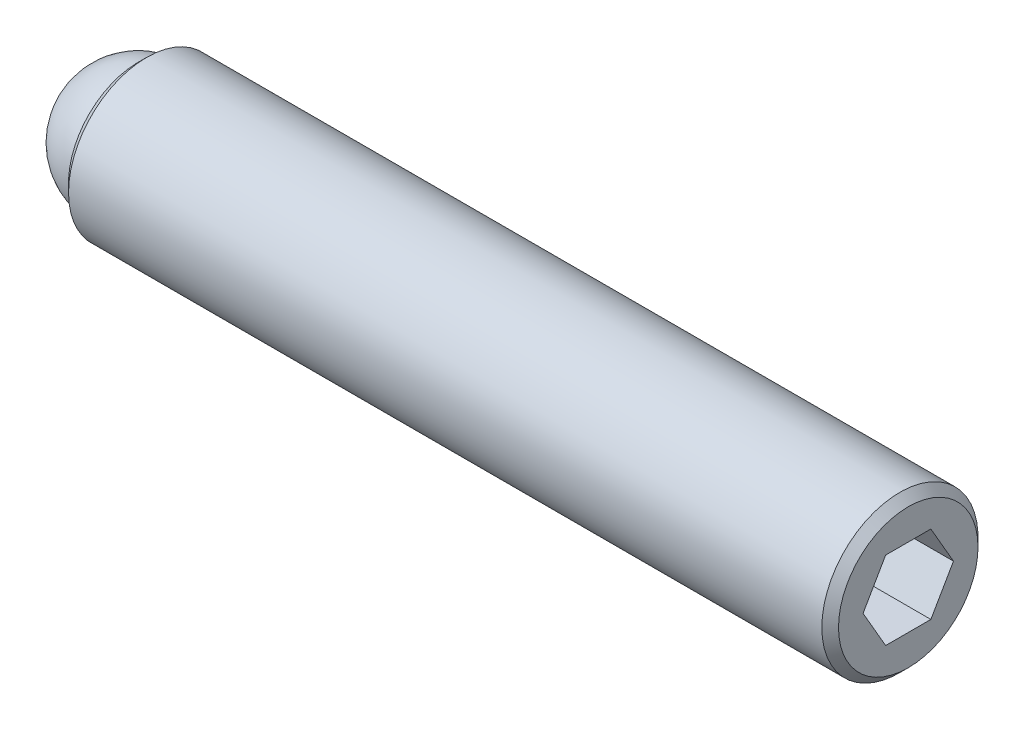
ISO-10303-21;
HEADER;
FILE_DESCRIPTION(('STEP AP214'),'2;1');
FILE_NAME('part.step','',(''),(''),'','','');
FILE_SCHEMA(('AUTOMOTIVE_DESIGN { 1 0 10303 214 1 1 1 1 }'));
ENDSEC;
DATA;
#1=APPLICATION_CONTEXT('core data for automotive mechanical design processes');
#2=APPLICATION_PROTOCOL_DEFINITION('international standard','automotive_design',2000,#1);
#3=PRODUCT_CONTEXT('',#1,'mechanical');
#4=PRODUCT('Part','Part','',(#3));
#5=PRODUCT_RELATED_PRODUCT_CATEGORY('part','',(#4));
#6=PRODUCT_DEFINITION_FORMATION('','',#4);
#7=PRODUCT_DEFINITION_CONTEXT('part definition',#1,'design');
#8=PRODUCT_DEFINITION('design','',#6,#7);
#9=PRODUCT_DEFINITION_SHAPE('','',#8);
#10=(LENGTH_UNIT() NAMED_UNIT(*) SI_UNIT(.MILLI.,.METRE.));
#11=(NAMED_UNIT(*) PLANE_ANGLE_UNIT() SI_UNIT($,.RADIAN.));
#12=(NAMED_UNIT(*) SI_UNIT($,.STERADIAN.) SOLID_ANGLE_UNIT());
#13=UNCERTAINTY_MEASURE_WITH_UNIT(LENGTH_MEASURE(1.E-05),#10,'distance_accuracy_value','');
#14=(GEOMETRIC_REPRESENTATION_CONTEXT(3) GLOBAL_UNCERTAINTY_ASSIGNED_CONTEXT((#13)) GLOBAL_UNIT_ASSIGNED_CONTEXT((#10,
#11,#12)) REPRESENTATION_CONTEXT('',''));
#15=CARTESIAN_POINT('',(0.,0.,0.));
#16=DIRECTION('',(0.,0.,1.));
#17=DIRECTION('',(1.,0.,0.));
#18=AXIS2_PLACEMENT_3D('',#15,#16,#17);
#19=CARTESIAN_POINT('',(0.,0.,0.));
#20=DIRECTION('',(0.,-1.,0.));
#21=DIRECTION('',(0.,0.,1.));
#22=AXIS2_PLACEMENT_3D('',#19,#20,#21);
#23=SPHERICAL_SURFACE('',#22,1.984375);
#24=CARTESIAN_POINT('',(0.,-1.984375,0.));
#25=VERTEX_POINT('',#24);
#26=VERTEX_LOOP('',#25);
#27=FACE_BOUND('',#26,.T.);
#28=ADVANCED_FACE('F41',(#27),#23,.T.);
#29=CLOSED_SHELL('',(#28));
#30=MANIFOLD_SOLID_BREP('B2',#29);
#31=CARTESIAN_POINT('',(23.415625,0.,0.));
#32=DIRECTION('',(-1.,0.,0.));
#33=DIRECTION('',(0.,0.,1.));
#34=AXIS2_PLACEMENT_3D('',#31,#32,#33);
#35=CYLINDRICAL_SURFACE('',#34,2.3749);
#36=CARTESIAN_POINT('',(23.161625,0.,0.));
#37=DIRECTION('',(1.,0.,0.));
#38=DIRECTION('',(0.,0.,-1.));
#39=AXIS2_PLACEMENT_3D('',#36,#37,#38);
#40=CIRCLE('',#39,2.3749);
#41=CARTESIAN_POINT('',(23.161625,0.,2.3749));
#42=VERTEX_POINT('',#41);
#43=EDGE_CURVE('E39',#42,#42,#40,.F.);
#44=CARTESIAN_POINT('',(0.254000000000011,0.,0.));
#45=DIRECTION('',(1.,0.,0.));
#46=DIRECTION('',(0.,0.,-1.));
#47=AXIS2_PLACEMENT_3D('',#44,#45,#46);
#48=CIRCLE('',#47,2.3749);
#49=CARTESIAN_POINT('',(0.254000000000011,0.,2.3749));
#50=VERTEX_POINT('',#49);
#51=EDGE_CURVE('E157',#50,#50,#48,.T.);
#52=CARTESIAN_POINT('',(23.161625,0.,2.3749));
#53=CARTESIAN_POINT('',(22.92300390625,0.,2.3749));
#54=CARTESIAN_POINT('',(22.6843828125,0.,2.3749));
#55=CARTESIAN_POINT('',(22.207140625,0.,2.3749));
#56=CARTESIAN_POINT('',(21.96851953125,0.,2.3749));
#57=CARTESIAN_POINT('',(21.49127734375,0.,2.3749));
#58=CARTESIAN_POINT('',(21.25265625,0.,2.3749));
#59=CARTESIAN_POINT('',(20.7754140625,0.,2.3749));
#60=CARTESIAN_POINT('',(20.53679296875,0.,2.3749));
#61=CARTESIAN_POINT('',(20.05955078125,0.,2.3749));
#62=CARTESIAN_POINT('',(19.8209296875,0.,2.3749));
#63=CARTESIAN_POINT('',(19.3436875,0.,2.3749));
#64=CARTESIAN_POINT('',(19.10506640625,0.,2.3749));
#65=CARTESIAN_POINT('',(18.62782421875,0.,2.3749));
#66=CARTESIAN_POINT('',(18.389203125,0.,2.3749));
#67=CARTESIAN_POINT('',(17.9119609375,0.,2.3749));
#68=CARTESIAN_POINT('',(17.67333984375,0.,2.3749));
#69=CARTESIAN_POINT('',(17.19609765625,0.,2.3749));
#70=CARTESIAN_POINT('',(16.9574765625,0.,2.3749));
#71=CARTESIAN_POINT('',(16.480234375,0.,2.3749));
#72=CARTESIAN_POINT('',(16.24161328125,0.,2.3749));
#73=CARTESIAN_POINT('',(15.76437109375,0.,2.3749));
#74=CARTESIAN_POINT('',(15.52575,0.,2.3749));
#75=CARTESIAN_POINT('',(15.0485078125,0.,2.3749));
#76=CARTESIAN_POINT('',(14.80988671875,0.,2.3749));
#77=CARTESIAN_POINT('',(14.33264453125,0.,2.3749));
#78=CARTESIAN_POINT('',(14.0940234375,0.,2.3749));
#79=CARTESIAN_POINT('',(13.61678125,0.,2.3749));
#80=CARTESIAN_POINT('',(13.37816015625,0.,2.3749));
#81=CARTESIAN_POINT('',(12.90091796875,0.,2.3749));
#82=CARTESIAN_POINT('',(12.662296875,0.,2.3749));
#83=CARTESIAN_POINT('',(12.1850546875,0.,2.3749));
#84=CARTESIAN_POINT('',(11.94643359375,0.,2.3749));
#85=CARTESIAN_POINT('',(11.46919140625,0.,2.3749));
#86=CARTESIAN_POINT('',(11.2305703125,0.,2.3749));
#87=CARTESIAN_POINT('',(10.753328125,0.,2.3749));
#88=CARTESIAN_POINT('',(10.51470703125,0.,2.3749));
#89=CARTESIAN_POINT('',(10.03746484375,0.,2.3749));
#90=CARTESIAN_POINT('',(9.79884375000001,0.,2.3749));
#91=CARTESIAN_POINT('',(9.32160156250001,0.,2.3749));
#92=CARTESIAN_POINT('',(9.08298046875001,0.,2.3749));
#93=CARTESIAN_POINT('',(8.60573828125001,0.,2.3749));
#94=CARTESIAN_POINT('',(8.36711718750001,0.,2.3749));
#95=CARTESIAN_POINT('',(7.88987500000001,0.,2.3749));
#96=CARTESIAN_POINT('',(7.65125390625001,0.,2.3749));
#97=CARTESIAN_POINT('',(7.17401171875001,0.,2.3749));
#98=CARTESIAN_POINT('',(6.93539062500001,0.,2.3749));
#99=CARTESIAN_POINT('',(6.45814843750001,0.,2.3749));
#100=CARTESIAN_POINT('',(6.21952734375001,0.,2.3749));
#101=CARTESIAN_POINT('',(5.74228515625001,0.,2.3749));
#102=CARTESIAN_POINT('',(5.50366406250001,0.,2.3749));
#103=CARTESIAN_POINT('',(5.02642187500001,0.,2.3749));
#104=CARTESIAN_POINT('',(4.78780078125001,0.,2.3749));
#105=CARTESIAN_POINT('',(4.31055859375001,0.,2.3749));
#106=CARTESIAN_POINT('',(4.07193750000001,0.,2.3749));
#107=CARTESIAN_POINT('',(3.59469531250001,0.,2.3749));
#108=CARTESIAN_POINT('',(3.35607421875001,0.,2.3749));
#109=CARTESIAN_POINT('',(2.87883203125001,0.,2.3749));
#110=CARTESIAN_POINT('',(2.64021093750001,0.,2.3749));
#111=CARTESIAN_POINT('',(2.16296875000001,0.,2.3749));
#112=CARTESIAN_POINT('',(1.92434765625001,0.,2.3749));
#113=CARTESIAN_POINT('',(1.44710546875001,0.,2.3749));
#114=CARTESIAN_POINT('',(1.20848437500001,0.,2.3749));
#115=CARTESIAN_POINT('',(0.731242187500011,0.,2.3749));
#116=CARTESIAN_POINT('',(0.492621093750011,0.,2.3749));
#117=CARTESIAN_POINT('',(0.254000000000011,0.,2.3749));
#118=B_SPLINE_CURVE_WITH_KNOTS('',3,(#52,#53,#54,#55,#56,#57,#58,#59,#60,#61,#62,#63,#64,#65,
#66,#67,#68,#69,#70,#71,#72,#73,#74,#75,#76,#77,#78,#79,#80,#81,#82,#83,#84,#85,#86,#87,#88,#89,
#90,#91,#92,#93,#94,#95,#96,#97,#98,#99,#100,#101,#102,#103,#104,#105,#106,#107,#108,#109,#110,
#111,#112,#113,#114,#115,#116,#117),.UNSPECIFIED.,.F.,.F.,(4,2,2,2,2,2,2,2,2,2,2,2,2,2,2,2,2,2,
2,2,2,2,2,2,2,2,2,2,2,2,2,2,4),(0.,0.71586328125,1.4317265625,2.14758984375,2.863453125,
3.57931640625,4.2951796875,5.01104296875,5.72690625,6.44276953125,7.1586328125,7.87449609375,
8.590359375,9.30622265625,10.0220859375,10.73794921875,11.4538125,12.16967578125,12.8855390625,
13.60140234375,14.317265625,15.03312890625,15.7489921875,16.46485546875,17.18071875,
17.89658203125,18.6124453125,19.32830859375,20.044171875,20.76003515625,21.4758984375,
22.19176171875,22.907625),.UNSPECIFIED.);
#119=EDGE_CURVE('BSEAM54',#42,#50,#118,.T.);
#120=ORIENTED_EDGE('',*,*,#43,.T.);
#121=ORIENTED_EDGE('',*,*,#51,.T.);
#122=ORIENTED_EDGE('',*,*,#119,.T.);
#123=ORIENTED_EDGE('',*,*,#119,.F.);
#124=EDGE_LOOP('',(#120,#122,#121,#123));
#125=FACE_BOUND('',#124,.T.);
#126=ADVANCED_FACE('F54',(#125),#35,.T.);
#127=CARTESIAN_POINT('',(23.415625,0.,0.));
#128=DIRECTION('',(1.,0.,0.));
#129=DIRECTION('',(0.,0.,-1.));
#130=AXIS2_PLACEMENT_3D('',#127,#128,#129);
#131=PLANE('',#130);
#132=DIRECTION('',(0.,0.866025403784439,-0.5));
#133=VECTOR('',#132,1.);
#134=CARTESIAN_POINT('',(23.415625,-1.190625,-0.687407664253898));
#135=LINE('',#134,#133);
#136=CARTESIAN_POINT('',(23.415625,-1.190625,-0.687407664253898));
#137=VERTEX_POINT('',#136);
#138=CARTESIAN_POINT('',(23.415625,0.,-1.3748153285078));
#139=VERTEX_POINT('',#138);
#140=EDGE_CURVE('E69',#137,#139,#135,.T.);
#141=ORIENTED_EDGE('',*,*,#140,.F.);
#142=DIRECTION('',(0.,0.,-1.));
#143=VECTOR('',#142,1.);
#144=CARTESIAN_POINT('',(23.415625,-1.190625,0.687407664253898));
#145=LINE('',#144,#143);
#146=CARTESIAN_POINT('',(23.415625,-1.190625,0.687407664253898));
#147=VERTEX_POINT('',#146);
#148=EDGE_CURVE('E153',#147,#137,#145,.T.);
#149=ORIENTED_EDGE('',*,*,#148,.F.);
#150=DIRECTION('',(0.,-0.866025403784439,-0.5));
#151=VECTOR('',#150,1.);
#152=CARTESIAN_POINT('',(23.415625,0.,1.3748153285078));
#153=LINE('',#152,#151);
#154=CARTESIAN_POINT('',(23.415625,0.,1.3748153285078));
#155=VERTEX_POINT('',#154);
#156=EDGE_CURVE('E151',#155,#147,#153,.T.);
#157=ORIENTED_EDGE('',*,*,#156,.F.);
#158=DIRECTION('',(0.,-0.866025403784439,0.5));
#159=VECTOR('',#158,1.);
#160=CARTESIAN_POINT('',(23.415625,1.190625,0.687407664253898));
#161=LINE('',#160,#159);
#162=CARTESIAN_POINT('',(23.415625,1.190625,0.687407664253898));
#163=VERTEX_POINT('',#162);
#164=EDGE_CURVE('E117',#163,#155,#161,.T.);
#165=ORIENTED_EDGE('',*,*,#164,.F.);
#166=DIRECTION('',(0.,0.,1.));
#167=VECTOR('',#166,1.);
#168=CARTESIAN_POINT('',(23.415625,1.190625,-0.687407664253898));
#169=LINE('',#168,#167);
#170=CARTESIAN_POINT('',(23.415625,1.190625,-0.687407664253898));
#171=VERTEX_POINT('',#170);
#172=EDGE_CURVE('E147',#171,#163,#169,.T.);
#173=ORIENTED_EDGE('',*,*,#172,.F.);
#174=DIRECTION('',(0.,0.866025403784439,0.5));
#175=VECTOR('',#174,1.);
#176=CARTESIAN_POINT('',(23.415625,0.,-1.3748153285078));
#177=LINE('',#176,#175);
#178=EDGE_CURVE('E143',#139,#171,#177,.T.);
#179=ORIENTED_EDGE('',*,*,#178,.F.);
#180=EDGE_LOOP('',(#141,#149,#157,#165,#173,#179));
#181=FACE_BOUND('',#180,.T.);
#182=CARTESIAN_POINT('',(23.415625,0.,0.));
#183=DIRECTION('',(1.,0.,0.));
#184=DIRECTION('',(0.,0.,-1.));
#185=AXIS2_PLACEMENT_3D('',#182,#183,#184);
#186=CIRCLE('',#185,2.12090000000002);
#187=CARTESIAN_POINT('',(23.415625,0.,-2.12090000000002));
#188=VERTEX_POINT('',#187);
#189=EDGE_CURVE('E62',#188,#188,#186,.T.);
#190=ORIENTED_EDGE('',*,*,#189,.T.);
#191=EDGE_LOOP('',(#190));
#192=FACE_BOUND('',#191,.T.);
#193=ADVANCED_FACE('F170',(#181,#192),#131,.T.);
#194=CARTESIAN_POINT('',(0.,0.,0.));
#195=DIRECTION('',(1.,0.,0.));
#196=DIRECTION('',(0.,0.,-1.));
#197=AXIS2_PLACEMENT_3D('',#194,#195,#196);
#198=PLANE('',#197);
#199=CARTESIAN_POINT('',(0.,0.,0.));
#200=DIRECTION('',(-1.,0.,0.));
#201=DIRECTION('',(0.,0.,1.));
#202=AXIS2_PLACEMENT_3D('',#199,#200,#201);
#203=CIRCLE('',#202,1.9812);
#204=CARTESIAN_POINT('',(0.,0.,1.9812));
#205=VERTEX_POINT('',#204);
#206=EDGE_CURVE('E225',#205,#205,#203,.T.);
#207=ORIENTED_EDGE('',*,*,#206,.F.);
#208=EDGE_LOOP('',(#207));
#209=FACE_BOUND('',#208,.T.);
#210=CARTESIAN_POINT('',(0.,0.,0.));
#211=DIRECTION('',(1.,0.,0.));
#212=DIRECTION('',(0.,0.,-1.));
#213=AXIS2_PLACEMENT_3D('',#210,#211,#212);
#214=CIRCLE('',#213,2.12089999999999);
#215=CARTESIAN_POINT('',(0.,0.,-2.12089999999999));
#216=VERTEX_POINT('',#215);
#217=EDGE_CURVE('E165',#216,#216,#214,.F.);
#218=ORIENTED_EDGE('',*,*,#217,.T.);
#219=EDGE_LOOP('',(#218));
#220=FACE_BOUND('',#219,.T.);
#221=ADVANCED_FACE('F182',(#209,#220),#198,.F.);
#222=CARTESIAN_POINT('',(0.254000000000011,0.,0.));
#223=DIRECTION('',(1.,0.,0.));
#224=DIRECTION('',(0.,0.,-1.));
#225=AXIS2_PLACEMENT_3D('',#222,#223,#224);
#226=CONICAL_SURFACE('',#225,2.3749,0.785398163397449);
#227=ORIENTED_EDGE('',*,*,#217,.F.);
#228=EDGE_LOOP('',(#227));
#229=FACE_BOUND('',#228,.T.);
#230=ORIENTED_EDGE('',*,*,#51,.F.);
#231=EDGE_LOOP('',(#230));
#232=FACE_BOUND('',#231,.T.);
#233=ADVANCED_FACE('F174',(#229,#232),#226,.T.);
#234=CARTESIAN_POINT('',(23.415625,0.,0.));
#235=DIRECTION('',(-1.,0.,0.));
#236=DIRECTION('',(0.,0.,1.));
#237=AXIS2_PLACEMENT_3D('',#234,#235,#236);
#238=CONICAL_SURFACE('',#237,2.12090000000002,0.785398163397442);
#239=ORIENTED_EDGE('',*,*,#43,.F.);
#240=EDGE_LOOP('',(#239));
#241=FACE_BOUND('',#240,.T.);
#242=ORIENTED_EDGE('',*,*,#189,.F.);
#243=EDGE_LOOP('',(#242));
#244=FACE_BOUND('',#243,.T.);
#245=ADVANCED_FACE('F56',(#241,#244),#238,.T.);
#246=CARTESIAN_POINT('',(21.129625,-1.190625,-0.687407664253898));
#247=DIRECTION('',(0.,-0.5,-0.866025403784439));
#248=DIRECTION('',(0.,0.866025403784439,-0.5));
#249=AXIS2_PLACEMENT_3D('',#246,#247,#248);
#250=PLANE('',#249);
#251=ORIENTED_EDGE('',*,*,#140,.T.);
#252=DIRECTION('',(1.,0.,0.));
#253=VECTOR('',#252,1.);
#254=CARTESIAN_POINT('',(21.129625,0.,-1.3748153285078));
#255=LINE('',#254,#253);
#256=CARTESIAN_POINT('',(21.129625,0.,-1.3748153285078));
#257=VERTEX_POINT('',#256);
#258=EDGE_CURVE('E99',#257,#139,#255,.T.);
#259=ORIENTED_EDGE('',*,*,#258,.F.);
#260=DIRECTION('',(0.,0.866025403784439,-0.5));
#261=VECTOR('',#260,1.);
#262=CARTESIAN_POINT('',(21.129625,-1.190625,-0.687407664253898));
#263=LINE('',#262,#261);
#264=CARTESIAN_POINT('',(21.129625,-1.190625,-0.687407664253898));
#265=VERTEX_POINT('',#264);
#266=EDGE_CURVE('E155',#265,#257,#263,.T.);
#267=ORIENTED_EDGE('',*,*,#266,.F.);
#268=DIRECTION('',(1.,0.,0.));
#269=VECTOR('',#268,1.);
#270=CARTESIAN_POINT('',(21.129625,-1.190625,-0.687407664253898));
#271=LINE('',#270,#269);
#272=EDGE_CURVE('E77',#265,#137,#271,.T.);
#273=ORIENTED_EDGE('',*,*,#272,.T.);
#274=EDGE_LOOP('',(#251,#259,#267,#273));
#275=FACE_BOUND('',#274,.T.);
#276=ADVANCED_FACE('F173',(#275),#250,.F.);
#277=CARTESIAN_POINT('',(21.129625,-1.190625,0.687407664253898));
#278=DIRECTION('',(0.,-1.,0.));
#279=DIRECTION('',(0.,0.,-1.));
#280=AXIS2_PLACEMENT_3D('',#277,#278,#279);
#281=PLANE('',#280);
#282=ORIENTED_EDGE('',*,*,#148,.T.);
#283=ORIENTED_EDGE('',*,*,#272,.F.);
#284=DIRECTION('',(0.,0.,-1.));
#285=VECTOR('',#284,1.);
#286=CARTESIAN_POINT('',(21.129625,-1.190625,0.687407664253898));
#287=LINE('',#286,#285);
#288=CARTESIAN_POINT('',(21.129625,-1.190625,0.687407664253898));
#289=VERTEX_POINT('',#288);
#290=EDGE_CURVE('E129',#289,#265,#287,.T.);
#291=ORIENTED_EDGE('',*,*,#290,.F.);
#292=DIRECTION('',(1.,0.,0.));
#293=VECTOR('',#292,1.);
#294=CARTESIAN_POINT('',(21.129625,-1.190625,0.687407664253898));
#295=LINE('',#294,#293);
#296=EDGE_CURVE('E121',#289,#147,#295,.T.);
#297=ORIENTED_EDGE('',*,*,#296,.T.);
#298=EDGE_LOOP('',(#282,#283,#291,#297));
#299=FACE_BOUND('',#298,.T.);
#300=ADVANCED_FACE('F180',(#299),#281,.F.);
#301=CARTESIAN_POINT('',(21.129625,0.,1.3748153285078));
#302=DIRECTION('',(0.,-0.5,0.866025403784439));
#303=DIRECTION('',(0.,-0.866025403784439,-0.5));
#304=AXIS2_PLACEMENT_3D('',#301,#302,#303);
#305=PLANE('',#304);
#306=ORIENTED_EDGE('',*,*,#156,.T.);
#307=ORIENTED_EDGE('',*,*,#296,.F.);
#308=DIRECTION('',(0.,-0.866025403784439,-0.5));
#309=VECTOR('',#308,1.);
#310=CARTESIAN_POINT('',(21.129625,0.,1.3748153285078));
#311=LINE('',#310,#309);
#312=CARTESIAN_POINT('',(21.129625,0.,1.3748153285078));
#313=VERTEX_POINT('',#312);
#314=EDGE_CURVE('E125',#313,#289,#311,.T.);
#315=ORIENTED_EDGE('',*,*,#314,.F.);
#316=DIRECTION('',(1.,0.,0.));
#317=VECTOR('',#316,1.);
#318=CARTESIAN_POINT('',(21.129625,0.,1.3748153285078));
#319=LINE('',#318,#317);
#320=EDGE_CURVE('E110',#313,#155,#319,.T.);
#321=ORIENTED_EDGE('',*,*,#320,.T.);
#322=EDGE_LOOP('',(#306,#307,#315,#321));
#323=FACE_BOUND('',#322,.T.);
#324=ADVANCED_FACE('F126',(#323),#305,.F.);
#325=CARTESIAN_POINT('',(21.129625,1.190625,0.687407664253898));
#326=DIRECTION('',(0.,0.5,0.866025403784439));
#327=DIRECTION('',(0.,-0.866025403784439,0.5));
#328=AXIS2_PLACEMENT_3D('',#325,#326,#327);
#329=PLANE('',#328);
#330=ORIENTED_EDGE('',*,*,#164,.T.);
#331=ORIENTED_EDGE('',*,*,#320,.F.);
#332=DIRECTION('',(0.,-0.866025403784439,0.5));
#333=VECTOR('',#332,1.);
#334=CARTESIAN_POINT('',(21.129625,1.190625,0.687407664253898));
#335=LINE('',#334,#333);
#336=CARTESIAN_POINT('',(21.129625,1.190625,0.687407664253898));
#337=VERTEX_POINT('',#336);
#338=EDGE_CURVE('E114',#337,#313,#335,.T.);
#339=ORIENTED_EDGE('',*,*,#338,.F.);
#340=DIRECTION('',(1.,0.,0.));
#341=VECTOR('',#340,1.);
#342=CARTESIAN_POINT('',(21.129625,1.190625,0.687407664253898));
#343=LINE('',#342,#341);
#344=EDGE_CURVE('E122',#337,#163,#343,.T.);
#345=ORIENTED_EDGE('',*,*,#344,.T.);
#346=EDGE_LOOP('',(#330,#331,#339,#345));
#347=FACE_BOUND('',#346,.T.);
#348=ADVANCED_FACE('F112',(#347),#329,.F.);
#349=CARTESIAN_POINT('',(21.129625,1.190625,-0.687407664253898));
#350=DIRECTION('',(0.,1.,0.));
#351=DIRECTION('',(0.,0.,1.));
#352=AXIS2_PLACEMENT_3D('',#349,#350,#351);
#353=PLANE('',#352);
#354=ORIENTED_EDGE('',*,*,#172,.T.);
#355=ORIENTED_EDGE('',*,*,#344,.F.);
#356=DIRECTION('',(0.,0.,1.));
#357=VECTOR('',#356,1.);
#358=CARTESIAN_POINT('',(21.129625,1.190625,-0.687407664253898));
#359=LINE('',#358,#357);
#360=CARTESIAN_POINT('',(21.129625,1.190625,-0.687407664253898));
#361=VERTEX_POINT('',#360);
#362=EDGE_CURVE('E135',#361,#337,#359,.T.);
#363=ORIENTED_EDGE('',*,*,#362,.F.);
#364=DIRECTION('',(1.,0.,0.));
#365=VECTOR('',#364,1.);
#366=CARTESIAN_POINT('',(21.129625,1.190625,-0.687407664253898));
#367=LINE('',#366,#365);
#368=EDGE_CURVE('E160',#361,#171,#367,.T.);
#369=ORIENTED_EDGE('',*,*,#368,.T.);
#370=EDGE_LOOP('',(#354,#355,#363,#369));
#371=FACE_BOUND('',#370,.T.);
#372=ADVANCED_FACE('F201',(#371),#353,.F.);
#373=CARTESIAN_POINT('',(21.129625,0.,-1.3748153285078));
#374=DIRECTION('',(0.,0.5,-0.866025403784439));
#375=DIRECTION('',(0.,0.866025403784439,0.5));
#376=AXIS2_PLACEMENT_3D('',#373,#374,#375);
#377=PLANE('',#376);
#378=ORIENTED_EDGE('',*,*,#178,.T.);
#379=ORIENTED_EDGE('',*,*,#368,.F.);
#380=DIRECTION('',(0.,0.866025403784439,0.5));
#381=VECTOR('',#380,1.);
#382=CARTESIAN_POINT('',(21.129625,0.,-1.3748153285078));
#383=LINE('',#382,#381);
#384=EDGE_CURVE('E137',#257,#361,#383,.T.);
#385=ORIENTED_EDGE('',*,*,#384,.F.);
#386=ORIENTED_EDGE('',*,*,#258,.T.);
#387=EDGE_LOOP('',(#378,#379,#385,#386));
#388=FACE_BOUND('',#387,.T.);
#389=ADVANCED_FACE('F198',(#388),#377,.F.);
#390=CARTESIAN_POINT('',(21.129625,0.,0.));
#391=DIRECTION('',(1.,0.,0.));
#392=DIRECTION('',(0.,0.,-1.));
#393=AXIS2_PLACEMENT_3D('',#390,#391,#392);
#394=PLANE('',#393);
#395=ORIENTED_EDGE('',*,*,#266,.T.);
#396=ORIENTED_EDGE('',*,*,#384,.T.);
#397=ORIENTED_EDGE('',*,*,#362,.T.);
#398=ORIENTED_EDGE('',*,*,#338,.T.);
#399=ORIENTED_EDGE('',*,*,#314,.T.);
#400=ORIENTED_EDGE('',*,*,#290,.T.);
#401=EDGE_LOOP('',(#395,#396,#397,#398,#399,#400));
#402=FACE_BOUND('',#401,.T.);
#403=ADVANCED_FACE('F132',(#402),#394,.T.);
#404=CARTESIAN_POINT('',(1.984375,0.,0.));
#405=DIRECTION('',(-1.,0.,0.));
#406=DIRECTION('',(0.,0.,1.));
#407=AXIS2_PLACEMENT_3D('',#404,#405,#406);
#408=CYLINDRICAL_SURFACE('',#407,1.9812);
#409=CARTESIAN_POINT('',(1.984375,0.,0.));
#410=DIRECTION('',(-1.,0.,0.));
#411=DIRECTION('',(0.,0.,1.));
#412=AXIS2_PLACEMENT_3D('',#409,#410,#411);
#413=CIRCLE('',#412,1.9812);
#414=CARTESIAN_POINT('',(1.984375,0.,1.9812));
#415=VERTEX_POINT('',#414);
#416=EDGE_CURVE('E144',#415,#415,#413,.T.);
#417=ORIENTED_EDGE('',*,*,#416,.F.);
#418=EDGE_LOOP('',(#417));
#419=FACE_BOUND('',#418,.T.);
#420=ORIENTED_EDGE('',*,*,#206,.T.);
#421=EDGE_LOOP('',(#420));
#422=FACE_BOUND('',#421,.T.);
#423=ADVANCED_FACE('F214',(#419,#422),#408,.F.);
#424=CARTESIAN_POINT('',(1.984375,0.,0.));
#425=DIRECTION('',(-1.,0.,0.));
#426=DIRECTION('',(0.,0.,1.));
#427=AXIS2_PLACEMENT_3D('',#424,#425,#426);
#428=PLANE('',#427);
#429=ORIENTED_EDGE('',*,*,#416,.T.);
#430=EDGE_LOOP('',(#429));
#431=FACE_BOUND('',#430,.T.);
#432=ADVANCED_FACE('F217',(#431),#428,.T.);
#433=CLOSED_SHELL('',(#126,#193,#221,#233,#245,#276,#300,#324,#348,#372,#389,#403,#423,#432));
#434=MANIFOLD_SOLID_BREP('B6',#433);
#435=ADVANCED_BREP_SHAPE_REPRESENTATION('',(#18,#30,#434),#14);
#436=SHAPE_DEFINITION_REPRESENTATION(#9,#435);
ENDSEC;
END-ISO-10303-21;
